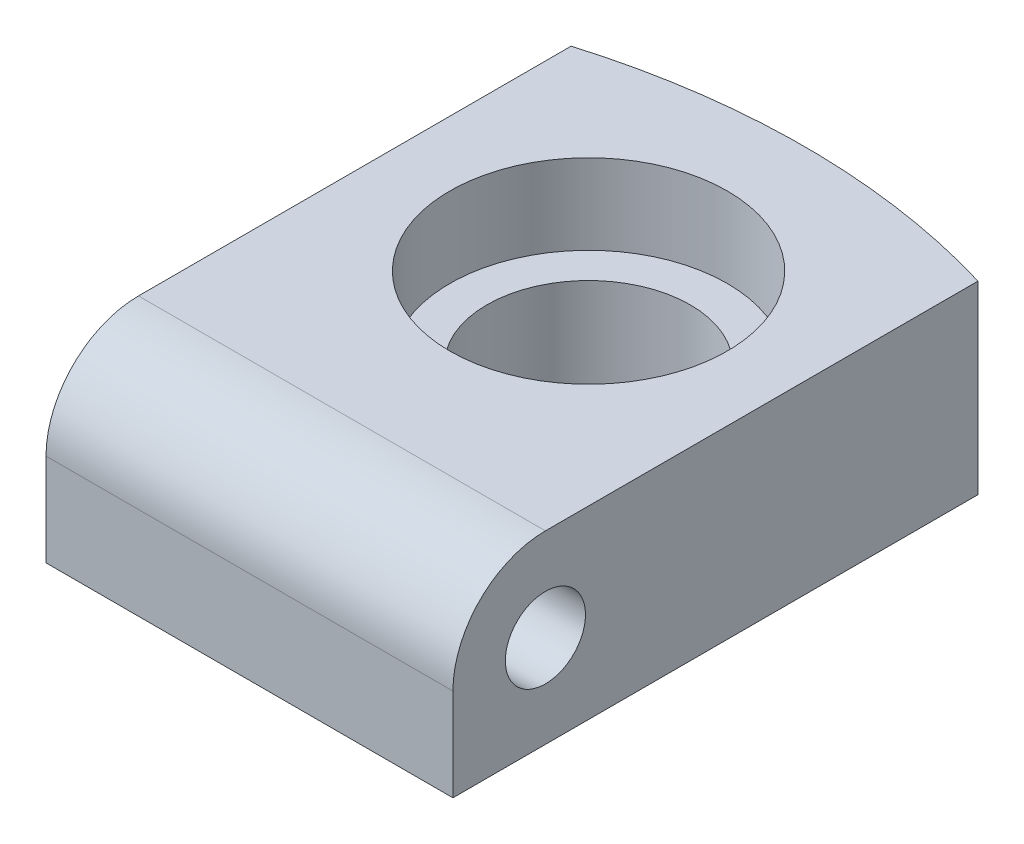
from build123d import *

# Parameters (mm, degrees)
BOSS_EXTRUDE1_DEPTH        = 66
F_13_0_13_DIAMETER_HOLE1_D = 13
HOLE1_D                    = 33
HOLE1_CBORE_D              = 45
HOLE1_CBORE_DEPTH          = 13
CUT_EXTRUDE1_DEPTH         = 116.568161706


with BuildPart() as part:
    # Sketch1 → Boss-Extrude1 (new body)
    with BuildSketch(Plane(origin=(0, 0, 0), x_dir=(0, 0, -1), z_dir=(1, 0, 0))):
        with BuildLine():
            Line((0, 0), (-90, 0))
            Line((-90, 0), (-90, 15))
            ThreePointArc((-90, 15), (-85.606601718, 25.606601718), (-75, 30))
            Line((-75, 30), (0, 30))
            Line((0, 30), (0, 0))
        make_face()
    extrude(amount=-BOSS_EXTRUDE1_DEPTH)

    # 13.0 _13_ Diameter Hole1 (through all)
    with Locations(Plane(origin=(0, 0, 0), x_dir=(0, 0, -1), z_dir=(1, 0, 0))):
        with Locations((-75, 15)):
            Hole(F_13_0_13_DIAMETER_HOLE1_D / 2)

    # Hole1 (through all)
    with Locations(Plane(origin=(0, 30, 0), x_dir=(1, 0, 0), z_dir=(0, 1, 0))):
        with Locations((-33, -35)):
            CounterBoreHole(HOLE1_D / 2, HOLE1_CBORE_D / 2, HOLE1_CBORE_DEPTH)

    # Sketch8 → Cut-Extrude1 (cut, through all)
    with BuildSketch(Plane(origin=(0, 30, 0), x_dir=(1, 0, 0), z_dir=(0, 1, 0))):
        with BuildLine():
            Line((-66, 0), (-66, -4.836485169))
            ThreePointArc((-66, -4.836485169), (-49.676267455, -1.215545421), (-32.999999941, 0))
            Line((-32.999999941, 0), (-66, 0))
        make_face()
        with BuildLine():
            Line((0, 0), (-32.999999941, 0))
            ThreePointArc((-32.999999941, 0), (-16.323732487, -1.21554543), (0, -4.836485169))
            Line((0, -4.836485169), (0, 0))
        make_face()
    extrude(amount=-CUT_EXTRUDE1_DEPTH, mode=Mode.SUBTRACT)


solid = part.part
